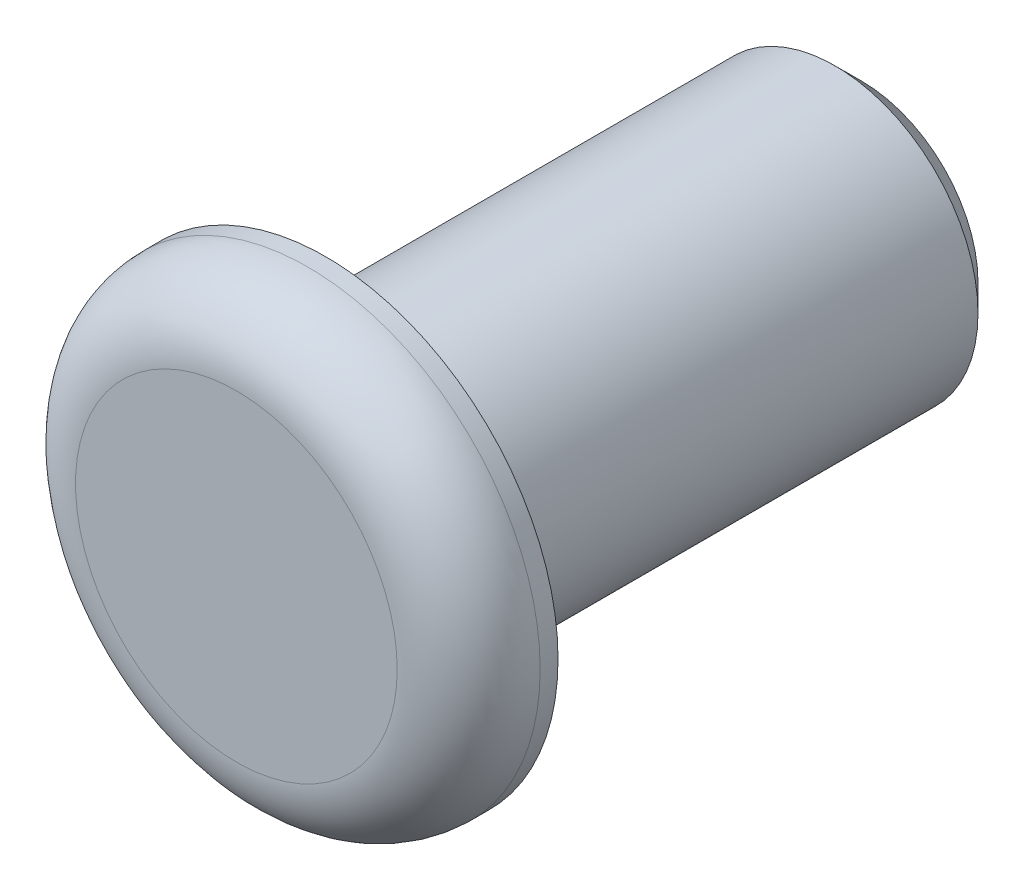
from build123d import *

# Parameters (mm, degrees)
SKETCH1_R           = 6.5
BOSS_EXTRUDE1_DEPTH = 2.5
SKETCH2_R           = 4
BOSS_EXTRUDE2_DEPTH = 15
CHAMFER1_SIZE       = 0.75
FILLET1_R           = 2


with BuildPart() as part:
    # Sketch1 → Boss-Extrude1 (new body)
    with BuildSketch(Plane.XY):
        Circle(SKETCH1_R)
    extrude(amount=BOSS_EXTRUDE1_DEPTH)

    # Sketch2 → Boss-Extrude2 (add)
    with BuildSketch(Plane(origin=(0, 0, 0), x_dir=(-1, 0, 0), z_dir=(0, 0, -1))):
        Circle(SKETCH2_R)
    extrude(amount=BOSS_EXTRUDE2_DEPTH)

    # Chamfer1
    chamfer1_edges = [part.edges().sort_by_distance(p)[0] for p in [
        (4, 0, -15),
    ]]
    chamfer(chamfer1_edges, length=CHAMFER1_SIZE)

    # Fillet1
    fillet1_edges = [part.edges().sort_by_distance(p)[0] for p in [
        (-6.5, 0, 2.5),
    ]]
    fillet(fillet1_edges, radius=FILLET1_R)


solid = part.part
